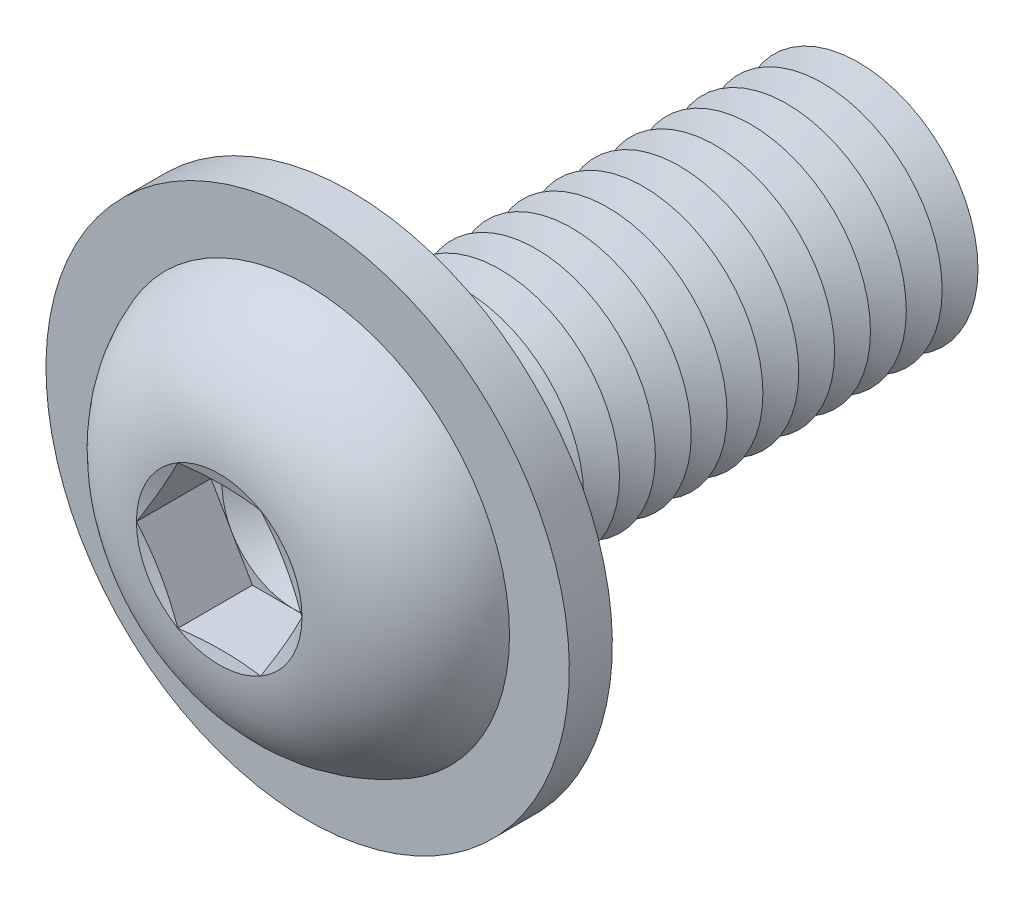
ISO-10303-21;
HEADER;
FILE_DESCRIPTION(('STEP AP214'),'2;1');
FILE_NAME('part.step','',(''),(''),'','','');
FILE_SCHEMA(('AUTOMOTIVE_DESIGN { 1 0 10303 214 1 1 1 1 }'));
ENDSEC;
DATA;
#1=APPLICATION_CONTEXT('core data for automotive mechanical design processes');
#2=APPLICATION_PROTOCOL_DEFINITION('international standard','automotive_design',2000,#1);
#3=PRODUCT_CONTEXT('',#1,'mechanical');
#4=PRODUCT('Part','Part','',(#3));
#5=PRODUCT_RELATED_PRODUCT_CATEGORY('part','',(#4));
#6=PRODUCT_DEFINITION_FORMATION('','',#4);
#7=PRODUCT_DEFINITION_CONTEXT('part definition',#1,'design');
#8=PRODUCT_DEFINITION('design','',#6,#7);
#9=PRODUCT_DEFINITION_SHAPE('','',#8);
#10=(LENGTH_UNIT() NAMED_UNIT(*) SI_UNIT(.MILLI.,.METRE.));
#11=(NAMED_UNIT(*) PLANE_ANGLE_UNIT() SI_UNIT($,.RADIAN.));
#12=(NAMED_UNIT(*) SI_UNIT($,.STERADIAN.) SOLID_ANGLE_UNIT());
#13=UNCERTAINTY_MEASURE_WITH_UNIT(LENGTH_MEASURE(1.E-05),#10,'distance_accuracy_value','');
#14=(GEOMETRIC_REPRESENTATION_CONTEXT(3) GLOBAL_UNCERTAINTY_ASSIGNED_CONTEXT((#13)) GLOBAL_UNIT_ASSIGNED_CONTEXT((#10,
#11,#12)) REPRESENTATION_CONTEXT('',''));
#15=CARTESIAN_POINT('',(0.,0.,0.));
#16=DIRECTION('',(0.,0.,1.));
#17=DIRECTION('',(1.,0.,0.));
#18=AXIS2_PLACEMENT_3D('',#15,#16,#17);
#19=CARTESIAN_POINT('',(0.,0.,-16.75));
#20=DIRECTION('',(0.,0.,1.));
#21=DIRECTION('',(1.,0.,0.));
#22=AXIS2_PLACEMENT_3D('',#19,#20,#21);
#23=CONICAL_SURFACE('',#22,5.00000000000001,1.0471975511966);
#24=CARTESIAN_POINT('',(0.,0.,-17.5));
#25=DIRECTION('',(0.,0.,1.));
#26=DIRECTION('',(1.,0.,0.));
#27=AXIS2_PLACEMENT_3D('',#24,#25,#26);
#28=CIRCLE('',#27,3.70096189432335);
#29=CARTESIAN_POINT('',(3.70096189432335,0.,-17.5));
#30=VERTEX_POINT('',#29);
#31=EDGE_CURVE('E406',#30,#30,#28,.T.);
#32=ORIENTED_EDGE('',*,*,#31,.T.);
#33=EDGE_LOOP('',(#32));
#34=FACE_BOUND('',#33,.T.);
#35=CARTESIAN_POINT('',(0.,0.,-16.75));
#36=DIRECTION('',(0.,0.,1.));
#37=DIRECTION('',(1.,0.,0.));
#38=AXIS2_PLACEMENT_3D('',#35,#36,#37);
#39=CIRCLE('',#38,5.00000000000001);
#40=CARTESIAN_POINT('',(5.00000000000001,0.,-16.75));
#41=VERTEX_POINT('',#40);
#42=EDGE_CURVE('E361',#41,#41,#39,.T.);
#43=ORIENTED_EDGE('',*,*,#42,.F.);
#44=EDGE_LOOP('',(#43));
#45=FACE_BOUND('',#44,.T.);
#46=ADVANCED_FACE('F39',(#34,#45),#23,.T.);
#47=CARTESIAN_POINT('',(0.,0.,-17.5));
#48=DIRECTION('',(0.,0.,-1.));
#49=DIRECTION('',(-1.,0.,0.));
#50=AXIS2_PLACEMENT_3D('',#47,#48,#49);
#51=CONICAL_SURFACE('',#50,3.70096189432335,1.0471975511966);
#52=CARTESIAN_POINT('',(0.,0.,-18.25));
#53=DIRECTION('',(0.,0.,1.));
#54=DIRECTION('',(1.,0.,0.));
#55=AXIS2_PLACEMENT_3D('',#52,#53,#54);
#56=CIRCLE('',#55,5.00000000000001);
#57=CARTESIAN_POINT('',(5.00000000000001,0.,-18.25));
#58=VERTEX_POINT('',#57);
#59=EDGE_CURVE('E408',#58,#58,#56,.T.);
#60=ORIENTED_EDGE('',*,*,#59,.T.);
#61=EDGE_LOOP('',(#60));
#62=FACE_BOUND('',#61,.T.);
#63=ORIENTED_EDGE('',*,*,#31,.F.);
#64=EDGE_LOOP('',(#63));
#65=FACE_BOUND('',#64,.T.);
#66=ADVANCED_FACE('F456',(#62,#65),#51,.T.);
#67=CARTESIAN_POINT('',(0.,5.00000000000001,-22.));
#68=DIRECTION('',(0.,0.,-1.));
#69=DIRECTION('',(-1.,0.,0.));
#70=AXIS2_PLACEMENT_3D('',#67,#68,#69);
#71=PLANE('',#70);
#72=CARTESIAN_POINT('',(0.,0.,-22.));
#73=DIRECTION('',(0.,0.,1.));
#74=DIRECTION('',(1.,0.,0.));
#75=AXIS2_PLACEMENT_3D('',#72,#73,#74);
#76=CIRCLE('',#75,3.70096189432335);
#77=CARTESIAN_POINT('',(3.70096189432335,0.,-22.));
#78=VERTEX_POINT('',#77);
#79=EDGE_CURVE('E307',#78,#78,#76,.T.);
#80=ORIENTED_EDGE('',*,*,#79,.F.);
#81=EDGE_LOOP('',(#80));
#82=FACE_BOUND('',#81,.T.);
#83=ADVANCED_FACE('F462',(#82),#71,.T.);
#84=CARTESIAN_POINT('',(0.,0.,-21.25));
#85=DIRECTION('',(0.,0.,1.));
#86=DIRECTION('',(1.,0.,0.));
#87=AXIS2_PLACEMENT_3D('',#84,#85,#86);
#88=CONICAL_SURFACE('',#87,5.00000000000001,1.0471975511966);
#89=ORIENTED_EDGE('',*,*,#79,.T.);
#90=EDGE_LOOP('',(#89));
#91=FACE_BOUND('',#90,.T.);
#92=CARTESIAN_POINT('',(0.,0.,-21.25));
#93=DIRECTION('',(0.,0.,1.));
#94=DIRECTION('',(1.,0.,0.));
#95=AXIS2_PLACEMENT_3D('',#92,#93,#94);
#96=CIRCLE('',#95,5.00000000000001);
#97=CARTESIAN_POINT('',(5.00000000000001,0.,-21.25));
#98=VERTEX_POINT('',#97);
#99=EDGE_CURVE('E494',#98,#98,#96,.T.);
#100=ORIENTED_EDGE('',*,*,#99,.F.);
#101=EDGE_LOOP('',(#100));
#102=FACE_BOUND('',#101,.T.);
#103=ADVANCED_FACE('F481',(#91,#102),#88,.T.);
#104=CARTESIAN_POINT('',(0.,0.,-20.5));
#105=DIRECTION('',(0.,0.,-1.));
#106=DIRECTION('',(-1.,0.,0.));
#107=AXIS2_PLACEMENT_3D('',#104,#105,#106);
#108=CONICAL_SURFACE('',#107,3.70096189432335,1.0471975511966);
#109=ORIENTED_EDGE('',*,*,#99,.T.);
#110=EDGE_LOOP('',(#109));
#111=FACE_BOUND('',#110,.T.);
#112=CARTESIAN_POINT('',(0.,0.,-20.5));
#113=DIRECTION('',(0.,0.,1.));
#114=DIRECTION('',(1.,0.,0.));
#115=AXIS2_PLACEMENT_3D('',#112,#113,#114);
#116=CIRCLE('',#115,3.70096189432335);
#117=CARTESIAN_POINT('',(3.70096189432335,0.,-20.5));
#118=VERTEX_POINT('',#117);
#119=EDGE_CURVE('E425',#118,#118,#116,.T.);
#120=ORIENTED_EDGE('',*,*,#119,.F.);
#121=EDGE_LOOP('',(#120));
#122=FACE_BOUND('',#121,.T.);
#123=ADVANCED_FACE('F478',(#111,#122),#108,.T.);
#124=CARTESIAN_POINT('',(0.,0.,-19.75));
#125=DIRECTION('',(0.,0.,1.));
#126=DIRECTION('',(1.,0.,0.));
#127=AXIS2_PLACEMENT_3D('',#124,#125,#126);
#128=CONICAL_SURFACE('',#127,5.00000000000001,1.0471975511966);
#129=ORIENTED_EDGE('',*,*,#119,.T.);
#130=EDGE_LOOP('',(#129));
#131=FACE_BOUND('',#130,.T.);
#132=CARTESIAN_POINT('',(0.,0.,-19.75));
#133=DIRECTION('',(0.,0.,1.));
#134=DIRECTION('',(1.,0.,0.));
#135=AXIS2_PLACEMENT_3D('',#132,#133,#134);
#136=CIRCLE('',#135,5.00000000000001);
#137=CARTESIAN_POINT('',(5.00000000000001,0.,-19.75));
#138=VERTEX_POINT('',#137);
#139=EDGE_CURVE('E423',#138,#138,#136,.T.);
#140=ORIENTED_EDGE('',*,*,#139,.F.);
#141=EDGE_LOOP('',(#140));
#142=FACE_BOUND('',#141,.T.);
#143=ADVANCED_FACE('F472',(#131,#142),#128,.T.);
#144=CARTESIAN_POINT('',(0.,0.,-19.));
#145=DIRECTION('',(0.,0.,-1.));
#146=DIRECTION('',(-1.,0.,0.));
#147=AXIS2_PLACEMENT_3D('',#144,#145,#146);
#148=CONICAL_SURFACE('',#147,3.70096189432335,1.0471975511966);
#149=ORIENTED_EDGE('',*,*,#139,.T.);
#150=EDGE_LOOP('',(#149));
#151=FACE_BOUND('',#150,.T.);
#152=CARTESIAN_POINT('',(0.,0.,-19.));
#153=DIRECTION('',(0.,0.,1.));
#154=DIRECTION('',(1.,0.,0.));
#155=AXIS2_PLACEMENT_3D('',#152,#153,#154);
#156=CIRCLE('',#155,3.70096189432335);
#157=CARTESIAN_POINT('',(3.70096189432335,0.,-19.));
#158=VERTEX_POINT('',#157);
#159=EDGE_CURVE('E426',#158,#158,#156,.T.);
#160=ORIENTED_EDGE('',*,*,#159,.F.);
#161=EDGE_LOOP('',(#160));
#162=FACE_BOUND('',#161,.T.);
#163=ADVANCED_FACE('F468',(#151,#162),#148,.T.);
#164=CARTESIAN_POINT('',(0.,0.,-18.25));
#165=DIRECTION('',(0.,0.,1.));
#166=DIRECTION('',(1.,0.,0.));
#167=AXIS2_PLACEMENT_3D('',#164,#165,#166);
#168=CONICAL_SURFACE('',#167,5.00000000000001,1.0471975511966);
#169=ORIENTED_EDGE('',*,*,#159,.T.);
#170=EDGE_LOOP('',(#169));
#171=FACE_BOUND('',#170,.T.);
#172=ORIENTED_EDGE('',*,*,#59,.F.);
#173=EDGE_LOOP('',(#172));
#174=FACE_BOUND('',#173,.T.);
#175=ADVANCED_FACE('F471',(#171,#174),#168,.T.);
#176=CARTESIAN_POINT('',(0.,0.,-15.25));
#177=DIRECTION('',(0.,0.,1.));
#178=DIRECTION('',(1.,0.,0.));
#179=AXIS2_PLACEMENT_3D('',#176,#177,#178);
#180=CONICAL_SURFACE('',#179,5.00000000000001,1.0471975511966);
#181=CARTESIAN_POINT('',(0.,0.,-16.));
#182=DIRECTION('',(0.,0.,1.));
#183=DIRECTION('',(1.,0.,0.));
#184=AXIS2_PLACEMENT_3D('',#181,#182,#183);
#185=CIRCLE('',#184,3.70096189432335);
#186=CARTESIAN_POINT('',(3.70096189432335,0.,-16.));
#187=VERTEX_POINT('',#186);
#188=EDGE_CURVE('E359',#187,#187,#185,.T.);
#189=ORIENTED_EDGE('',*,*,#188,.T.);
#190=EDGE_LOOP('',(#189));
#191=FACE_BOUND('',#190,.T.);
#192=CARTESIAN_POINT('',(0.,0.,-15.25));
#193=DIRECTION('',(0.,0.,1.));
#194=DIRECTION('',(1.,0.,0.));
#195=AXIS2_PLACEMENT_3D('',#192,#193,#194);
#196=CIRCLE('',#195,5.00000000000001);
#197=CARTESIAN_POINT('',(5.00000000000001,0.,-15.25));
#198=VERTEX_POINT('',#197);
#199=EDGE_CURVE('E356',#198,#198,#196,.T.);
#200=ORIENTED_EDGE('',*,*,#199,.F.);
#201=EDGE_LOOP('',(#200));
#202=FACE_BOUND('',#201,.T.);
#203=ADVANCED_FACE('F476',(#191,#202),#180,.T.);
#204=CARTESIAN_POINT('',(0.,0.,-16.));
#205=DIRECTION('',(0.,0.,-1.));
#206=DIRECTION('',(-1.,0.,0.));
#207=AXIS2_PLACEMENT_3D('',#204,#205,#206);
#208=CONICAL_SURFACE('',#207,3.70096189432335,1.0471975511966);
#209=ORIENTED_EDGE('',*,*,#42,.T.);
#210=EDGE_LOOP('',(#209));
#211=FACE_BOUND('',#210,.T.);
#212=ORIENTED_EDGE('',*,*,#188,.F.);
#213=EDGE_LOOP('',(#212));
#214=FACE_BOUND('',#213,.T.);
#215=ADVANCED_FACE('F595',(#211,#214),#208,.T.);
#216=CARTESIAN_POINT('',(0.,0.,-13.75));
#217=DIRECTION('',(0.,0.,1.));
#218=DIRECTION('',(1.,0.,0.));
#219=AXIS2_PLACEMENT_3D('',#216,#217,#218);
#220=CONICAL_SURFACE('',#219,5.00000000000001,1.0471975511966);
#221=CARTESIAN_POINT('',(0.,0.,-14.5));
#222=DIRECTION('',(0.,0.,1.));
#223=DIRECTION('',(1.,0.,0.));
#224=AXIS2_PLACEMENT_3D('',#221,#222,#223);
#225=CIRCLE('',#224,3.70096189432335);
#226=CARTESIAN_POINT('',(3.70096189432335,0.,-14.5));
#227=VERTEX_POINT('',#226);
#228=EDGE_CURVE('E353',#227,#227,#225,.T.);
#229=ORIENTED_EDGE('',*,*,#228,.T.);
#230=EDGE_LOOP('',(#229));
#231=FACE_BOUND('',#230,.T.);
#232=CARTESIAN_POINT('',(0.,0.,-13.75));
#233=DIRECTION('',(0.,0.,1.));
#234=DIRECTION('',(1.,0.,0.));
#235=AXIS2_PLACEMENT_3D('',#232,#233,#234);
#236=CIRCLE('',#235,5.00000000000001);
#237=CARTESIAN_POINT('',(5.00000000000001,0.,-13.75));
#238=VERTEX_POINT('',#237);
#239=EDGE_CURVE('E357',#238,#238,#236,.T.);
#240=ORIENTED_EDGE('',*,*,#239,.F.);
#241=EDGE_LOOP('',(#240));
#242=FACE_BOUND('',#241,.T.);
#243=ADVANCED_FACE('F591',(#231,#242),#220,.T.);
#244=CARTESIAN_POINT('',(0.,0.,-14.5));
#245=DIRECTION('',(0.,0.,-1.));
#246=DIRECTION('',(-1.,0.,0.));
#247=AXIS2_PLACEMENT_3D('',#244,#245,#246);
#248=CONICAL_SURFACE('',#247,3.70096189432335,1.0471975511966);
#249=ORIENTED_EDGE('',*,*,#199,.T.);
#250=EDGE_LOOP('',(#249));
#251=FACE_BOUND('',#250,.T.);
#252=ORIENTED_EDGE('',*,*,#228,.F.);
#253=EDGE_LOOP('',(#252));
#254=FACE_BOUND('',#253,.T.);
#255=ADVANCED_FACE('F587',(#251,#254),#248,.T.);
#256=CARTESIAN_POINT('',(0.,0.,-12.25));
#257=DIRECTION('',(0.,0.,1.));
#258=DIRECTION('',(1.,0.,0.));
#259=AXIS2_PLACEMENT_3D('',#256,#257,#258);
#260=CONICAL_SURFACE('',#259,5.00000000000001,1.0471975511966);
#261=CARTESIAN_POINT('',(0.,0.,-13.));
#262=DIRECTION('',(0.,0.,1.));
#263=DIRECTION('',(1.,0.,0.));
#264=AXIS2_PLACEMENT_3D('',#261,#262,#263);
#265=CIRCLE('',#264,3.70096189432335);
#266=CARTESIAN_POINT('',(3.70096189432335,0.,-13.));
#267=VERTEX_POINT('',#266);
#268=EDGE_CURVE('E403',#267,#267,#265,.T.);
#269=ORIENTED_EDGE('',*,*,#268,.T.);
#270=EDGE_LOOP('',(#269));
#271=FACE_BOUND('',#270,.T.);
#272=CARTESIAN_POINT('',(0.,0.,-12.25));
#273=DIRECTION('',(0.,0.,1.));
#274=DIRECTION('',(1.,0.,0.));
#275=AXIS2_PLACEMENT_3D('',#272,#273,#274);
#276=CIRCLE('',#275,5.00000000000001);
#277=CARTESIAN_POINT('',(5.00000000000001,0.,-12.25));
#278=VERTEX_POINT('',#277);
#279=EDGE_CURVE('E417',#278,#278,#276,.T.);
#280=ORIENTED_EDGE('',*,*,#279,.F.);
#281=EDGE_LOOP('',(#280));
#282=FACE_BOUND('',#281,.T.);
#283=ADVANCED_FACE('F583',(#271,#282),#260,.T.);
#284=CARTESIAN_POINT('',(0.,0.,-13.));
#285=DIRECTION('',(0.,0.,-1.));
#286=DIRECTION('',(-1.,0.,0.));
#287=AXIS2_PLACEMENT_3D('',#284,#285,#286);
#288=CONICAL_SURFACE('',#287,3.70096189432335,1.0471975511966);
#289=ORIENTED_EDGE('',*,*,#239,.T.);
#290=EDGE_LOOP('',(#289));
#291=FACE_BOUND('',#290,.T.);
#292=ORIENTED_EDGE('',*,*,#268,.F.);
#293=EDGE_LOOP('',(#292));
#294=FACE_BOUND('',#293,.T.);
#295=ADVANCED_FACE('F579',(#291,#294),#288,.T.);
#296=CARTESIAN_POINT('',(0.,0.,-10.75));
#297=DIRECTION('',(0.,0.,1.));
#298=DIRECTION('',(1.,0.,0.));
#299=AXIS2_PLACEMENT_3D('',#296,#297,#298);
#300=CONICAL_SURFACE('',#299,5.00000000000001,1.0471975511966);
#301=CARTESIAN_POINT('',(0.,0.,-11.5));
#302=DIRECTION('',(0.,0.,1.));
#303=DIRECTION('',(1.,0.,0.));
#304=AXIS2_PLACEMENT_3D('',#301,#302,#303);
#305=CIRCLE('',#304,3.70096189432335);
#306=CARTESIAN_POINT('',(3.70096189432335,0.,-11.5));
#307=VERTEX_POINT('',#306);
#308=EDGE_CURVE('E414',#307,#307,#305,.T.);
#309=ORIENTED_EDGE('',*,*,#308,.T.);
#310=EDGE_LOOP('',(#309));
#311=FACE_BOUND('',#310,.T.);
#312=CARTESIAN_POINT('',(0.,0.,-10.75));
#313=DIRECTION('',(0.,0.,1.));
#314=DIRECTION('',(1.,0.,0.));
#315=AXIS2_PLACEMENT_3D('',#312,#313,#314);
#316=CIRCLE('',#315,5.00000000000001);
#317=CARTESIAN_POINT('',(5.00000000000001,0.,-10.75));
#318=VERTEX_POINT('',#317);
#319=EDGE_CURVE('E418',#318,#318,#316,.T.);
#320=ORIENTED_EDGE('',*,*,#319,.F.);
#321=EDGE_LOOP('',(#320));
#322=FACE_BOUND('',#321,.T.);
#323=ADVANCED_FACE('F575',(#311,#322),#300,.T.);
#324=CARTESIAN_POINT('',(0.,0.,-11.5));
#325=DIRECTION('',(0.,0.,-1.));
#326=DIRECTION('',(-1.,0.,0.));
#327=AXIS2_PLACEMENT_3D('',#324,#325,#326);
#328=CONICAL_SURFACE('',#327,3.70096189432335,1.0471975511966);
#329=ORIENTED_EDGE('',*,*,#279,.T.);
#330=EDGE_LOOP('',(#329));
#331=FACE_BOUND('',#330,.T.);
#332=ORIENTED_EDGE('',*,*,#308,.F.);
#333=EDGE_LOOP('',(#332));
#334=FACE_BOUND('',#333,.T.);
#335=ADVANCED_FACE('F571',(#331,#334),#328,.T.);
#336=CARTESIAN_POINT('',(0.,0.,-9.25));
#337=DIRECTION('',(0.,0.,1.));
#338=DIRECTION('',(1.,0.,0.));
#339=AXIS2_PLACEMENT_3D('',#336,#337,#338);
#340=CONICAL_SURFACE('',#339,5.00000000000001,1.0471975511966);
#341=CARTESIAN_POINT('',(0.,0.,-10.));
#342=DIRECTION('',(0.,0.,1.));
#343=DIRECTION('',(1.,0.,0.));
#344=AXIS2_PLACEMENT_3D('',#341,#342,#343);
#345=CIRCLE('',#344,3.70096189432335);
#346=CARTESIAN_POINT('',(3.70096189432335,0.,-10.));
#347=VERTEX_POINT('',#346);
#348=EDGE_CURVE('E519',#347,#347,#345,.T.);
#349=ORIENTED_EDGE('',*,*,#348,.T.);
#350=EDGE_LOOP('',(#349));
#351=FACE_BOUND('',#350,.T.);
#352=CARTESIAN_POINT('',(0.,0.,-9.25));
#353=DIRECTION('',(0.,0.,1.));
#354=DIRECTION('',(1.,0.,0.));
#355=AXIS2_PLACEMENT_3D('',#352,#353,#354);
#356=CIRCLE('',#355,5.00000000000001);
#357=CARTESIAN_POINT('',(5.00000000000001,0.,-9.25));
#358=VERTEX_POINT('',#357);
#359=EDGE_CURVE('E439',#358,#358,#356,.T.);
#360=ORIENTED_EDGE('',*,*,#359,.F.);
#361=EDGE_LOOP('',(#360));
#362=FACE_BOUND('',#361,.T.);
#363=ADVANCED_FACE('F567',(#351,#362),#340,.T.);
#364=CARTESIAN_POINT('',(0.,0.,-10.));
#365=DIRECTION('',(0.,0.,-1.));
#366=DIRECTION('',(-1.,0.,0.));
#367=AXIS2_PLACEMENT_3D('',#364,#365,#366);
#368=CONICAL_SURFACE('',#367,3.70096189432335,1.0471975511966);
#369=ORIENTED_EDGE('',*,*,#319,.T.);
#370=EDGE_LOOP('',(#369));
#371=FACE_BOUND('',#370,.T.);
#372=ORIENTED_EDGE('',*,*,#348,.F.);
#373=EDGE_LOOP('',(#372));
#374=FACE_BOUND('',#373,.T.);
#375=ADVANCED_FACE('F563',(#371,#374),#368,.T.);
#376=CARTESIAN_POINT('',(0.,0.,-7.75));
#377=DIRECTION('',(0.,0.,1.));
#378=DIRECTION('',(1.,0.,0.));
#379=AXIS2_PLACEMENT_3D('',#376,#377,#378);
#380=CONICAL_SURFACE('',#379,5.00000000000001,1.0471975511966);
#381=CARTESIAN_POINT('',(0.,0.,-8.5));
#382=DIRECTION('',(0.,0.,1.));
#383=DIRECTION('',(1.,0.,0.));
#384=AXIS2_PLACEMENT_3D('',#381,#382,#383);
#385=CIRCLE('',#384,3.70096189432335);
#386=CARTESIAN_POINT('',(3.70096189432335,0.,-8.5));
#387=VERTEX_POINT('',#386);
#388=EDGE_CURVE('E436',#387,#387,#385,.T.);
#389=ORIENTED_EDGE('',*,*,#388,.T.);
#390=EDGE_LOOP('',(#389));
#391=FACE_BOUND('',#390,.T.);
#392=CARTESIAN_POINT('',(0.,0.,-7.75));
#393=DIRECTION('',(0.,0.,1.));
#394=DIRECTION('',(1.,0.,0.));
#395=AXIS2_PLACEMENT_3D('',#392,#393,#394);
#396=CIRCLE('',#395,5.00000000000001);
#397=CARTESIAN_POINT('',(5.00000000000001,0.,-7.75));
#398=VERTEX_POINT('',#397);
#399=EDGE_CURVE('E346',#398,#398,#396,.T.);
#400=ORIENTED_EDGE('',*,*,#399,.F.);
#401=EDGE_LOOP('',(#400));
#402=FACE_BOUND('',#401,.T.);
#403=ADVANCED_FACE('F559',(#391,#402),#380,.T.);
#404=CARTESIAN_POINT('',(0.,0.,-8.5));
#405=DIRECTION('',(0.,0.,-1.));
#406=DIRECTION('',(-1.,0.,0.));
#407=AXIS2_PLACEMENT_3D('',#404,#405,#406);
#408=CONICAL_SURFACE('',#407,3.70096189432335,1.0471975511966);
#409=ORIENTED_EDGE('',*,*,#359,.T.);
#410=EDGE_LOOP('',(#409));
#411=FACE_BOUND('',#410,.T.);
#412=ORIENTED_EDGE('',*,*,#388,.F.);
#413=EDGE_LOOP('',(#412));
#414=FACE_BOUND('',#413,.T.);
#415=ADVANCED_FACE('F555',(#411,#414),#408,.T.);
#416=CARTESIAN_POINT('',(0.,0.,-6.25));
#417=DIRECTION('',(0.,0.,1.));
#418=DIRECTION('',(1.,0.,0.));
#419=AXIS2_PLACEMENT_3D('',#416,#417,#418);
#420=CONICAL_SURFACE('',#419,5.00000000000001,1.0471975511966);
#421=CARTESIAN_POINT('',(0.,0.,-7.));
#422=DIRECTION('',(0.,0.,1.));
#423=DIRECTION('',(1.,0.,0.));
#424=AXIS2_PLACEMENT_3D('',#421,#422,#423);
#425=CIRCLE('',#424,3.70096189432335);
#426=CARTESIAN_POINT('',(3.70096189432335,0.,-7.));
#427=VERTEX_POINT('',#426);
#428=EDGE_CURVE('E336',#427,#427,#425,.T.);
#429=ORIENTED_EDGE('',*,*,#428,.T.);
#430=EDGE_LOOP('',(#429));
#431=FACE_BOUND('',#430,.T.);
#432=CARTESIAN_POINT('',(0.,0.,-6.25));
#433=DIRECTION('',(0.,0.,1.));
#434=DIRECTION('',(1.,0.,0.));
#435=AXIS2_PLACEMENT_3D('',#432,#433,#434);
#436=CIRCLE('',#435,5.00000000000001);
#437=CARTESIAN_POINT('',(5.00000000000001,0.,-6.25));
#438=VERTEX_POINT('',#437);
#439=EDGE_CURVE('E334',#438,#438,#436,.T.);
#440=ORIENTED_EDGE('',*,*,#439,.F.);
#441=EDGE_LOOP('',(#440));
#442=FACE_BOUND('',#441,.T.);
#443=ADVANCED_FACE('F548',(#431,#442),#420,.T.);
#444=CARTESIAN_POINT('',(0.,0.,-7.));
#445=DIRECTION('',(0.,0.,-1.));
#446=DIRECTION('',(-1.,0.,0.));
#447=AXIS2_PLACEMENT_3D('',#444,#445,#446);
#448=CONICAL_SURFACE('',#447,3.70096189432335,1.0471975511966);
#449=ORIENTED_EDGE('',*,*,#399,.T.);
#450=EDGE_LOOP('',(#449));
#451=FACE_BOUND('',#450,.T.);
#452=ORIENTED_EDGE('',*,*,#428,.F.);
#453=EDGE_LOOP('',(#452));
#454=FACE_BOUND('',#453,.T.);
#455=ADVANCED_FACE('F538',(#451,#454),#448,.T.);
#456=CARTESIAN_POINT('',(0.,0.,-4.75));
#457=DIRECTION('',(0.,0.,1.));
#458=DIRECTION('',(1.,0.,0.));
#459=AXIS2_PLACEMENT_3D('',#456,#457,#458);
#460=CONICAL_SURFACE('',#459,5.00000000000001,1.0471975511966);
#461=CARTESIAN_POINT('',(0.,0.,-5.5));
#462=DIRECTION('',(0.,0.,1.));
#463=DIRECTION('',(1.,0.,0.));
#464=AXIS2_PLACEMENT_3D('',#461,#462,#463);
#465=CIRCLE('',#464,3.70096189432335);
#466=CARTESIAN_POINT('',(3.70096189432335,0.,-5.5));
#467=VERTEX_POINT('',#466);
#468=EDGE_CURVE('E337',#467,#467,#465,.T.);
#469=ORIENTED_EDGE('',*,*,#468,.T.);
#470=EDGE_LOOP('',(#469));
#471=FACE_BOUND('',#470,.T.);
#472=CARTESIAN_POINT('',(0.,0.,-4.75));
#473=DIRECTION('',(0.,0.,1.));
#474=DIRECTION('',(1.,0.,0.));
#475=AXIS2_PLACEMENT_3D('',#472,#473,#474);
#476=CIRCLE('',#475,5.00000000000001);
#477=CARTESIAN_POINT('',(5.00000000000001,0.,-4.75));
#478=VERTEX_POINT('',#477);
#479=EDGE_CURVE('E331',#478,#478,#476,.T.);
#480=ORIENTED_EDGE('',*,*,#479,.F.);
#481=EDGE_LOOP('',(#480));
#482=FACE_BOUND('',#481,.T.);
#483=ADVANCED_FACE('F535',(#471,#482),#460,.T.);
#484=CARTESIAN_POINT('',(0.,0.,-5.5));
#485=DIRECTION('',(0.,0.,-1.));
#486=DIRECTION('',(-1.,0.,0.));
#487=AXIS2_PLACEMENT_3D('',#484,#485,#486);
#488=CONICAL_SURFACE('',#487,3.70096189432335,1.0471975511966);
#489=ORIENTED_EDGE('',*,*,#439,.T.);
#490=EDGE_LOOP('',(#489));
#491=FACE_BOUND('',#490,.T.);
#492=ORIENTED_EDGE('',*,*,#468,.F.);
#493=EDGE_LOOP('',(#492));
#494=FACE_BOUND('',#493,.T.);
#495=ADVANCED_FACE('F537',(#491,#494),#488,.T.);
#496=CARTESIAN_POINT('',(0.,0.,-3.25));
#497=DIRECTION('',(0.,0.,1.));
#498=DIRECTION('',(1.,0.,0.));
#499=AXIS2_PLACEMENT_3D('',#496,#497,#498);
#500=CONICAL_SURFACE('',#499,5.00000000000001,1.0471975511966);
#501=CARTESIAN_POINT('',(0.,0.,-4.));
#502=DIRECTION('',(0.,0.,1.));
#503=DIRECTION('',(1.,0.,0.));
#504=AXIS2_PLACEMENT_3D('',#501,#502,#503);
#505=CIRCLE('',#504,3.70096189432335);
#506=CARTESIAN_POINT('',(3.70096189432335,0.,-4.));
#507=VERTEX_POINT('',#506);
#508=EDGE_CURVE('E328',#507,#507,#505,.T.);
#509=ORIENTED_EDGE('',*,*,#508,.T.);
#510=EDGE_LOOP('',(#509));
#511=FACE_BOUND('',#510,.T.);
#512=CARTESIAN_POINT('',(0.,0.,-3.25));
#513=DIRECTION('',(0.,0.,1.));
#514=DIRECTION('',(1.,0.,0.));
#515=AXIS2_PLACEMENT_3D('',#512,#513,#514);
#516=CIRCLE('',#515,5.00000000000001);
#517=CARTESIAN_POINT('',(5.00000000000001,0.,-3.25));
#518=VERTEX_POINT('',#517);
#519=EDGE_CURVE('E342',#518,#518,#516,.T.);
#520=ORIENTED_EDGE('',*,*,#519,.F.);
#521=EDGE_LOOP('',(#520));
#522=FACE_BOUND('',#521,.T.);
#523=ADVANCED_FACE('F545',(#511,#522),#500,.T.);
#524=CARTESIAN_POINT('',(0.,0.,-4.));
#525=DIRECTION('',(0.,0.,-1.));
#526=DIRECTION('',(-1.,0.,0.));
#527=AXIS2_PLACEMENT_3D('',#524,#525,#526);
#528=CONICAL_SURFACE('',#527,3.70096189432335,1.0471975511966);
#529=ORIENTED_EDGE('',*,*,#479,.T.);
#530=EDGE_LOOP('',(#529));
#531=FACE_BOUND('',#530,.T.);
#532=ORIENTED_EDGE('',*,*,#508,.F.);
#533=EDGE_LOOP('',(#532));
#534=FACE_BOUND('',#533,.T.);
#535=ADVANCED_FACE('F532',(#531,#534),#528,.T.);
#536=CARTESIAN_POINT('',(0.,0.,-1.75));
#537=DIRECTION('',(0.,0.,1.));
#538=DIRECTION('',(1.,0.,0.));
#539=AXIS2_PLACEMENT_3D('',#536,#537,#538);
#540=CONICAL_SURFACE('',#539,5.00000000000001,1.0471975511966);
#541=CARTESIAN_POINT('',(0.,0.,-2.5));
#542=DIRECTION('',(0.,0.,1.));
#543=DIRECTION('',(1.,0.,0.));
#544=AXIS2_PLACEMENT_3D('',#541,#542,#543);
#545=CIRCLE('',#544,3.70096189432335);
#546=CARTESIAN_POINT('',(3.70096189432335,0.,-2.5));
#547=VERTEX_POINT('',#546);
#548=EDGE_CURVE('E227',#547,#547,#545,.T.);
#549=ORIENTED_EDGE('',*,*,#548,.T.);
#550=EDGE_LOOP('',(#549));
#551=FACE_BOUND('',#550,.T.);
#552=CARTESIAN_POINT('',(0.,0.,-1.75));
#553=DIRECTION('',(0.,0.,1.));
#554=DIRECTION('',(1.,0.,0.));
#555=AXIS2_PLACEMENT_3D('',#552,#553,#554);
#556=CIRCLE('',#555,5.00000000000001);
#557=CARTESIAN_POINT('',(5.00000000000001,0.,-1.75));
#558=VERTEX_POINT('',#557);
#559=EDGE_CURVE('E332',#558,#558,#556,.T.);
#560=ORIENTED_EDGE('',*,*,#559,.F.);
#561=EDGE_LOOP('',(#560));
#562=FACE_BOUND('',#561,.T.);
#563=ADVANCED_FACE('F696',(#551,#562),#540,.T.);
#564=CARTESIAN_POINT('',(0.,0.,-2.5));
#565=DIRECTION('',(0.,0.,-1.));
#566=DIRECTION('',(-1.,0.,0.));
#567=AXIS2_PLACEMENT_3D('',#564,#565,#566);
#568=CONICAL_SURFACE('',#567,3.70096189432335,1.0471975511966);
#569=ORIENTED_EDGE('',*,*,#519,.T.);
#570=EDGE_LOOP('',(#569));
#571=FACE_BOUND('',#570,.T.);
#572=ORIENTED_EDGE('',*,*,#548,.F.);
#573=EDGE_LOOP('',(#572));
#574=FACE_BOUND('',#573,.T.);
#575=ADVANCED_FACE('F211',(#571,#574),#568,.T.);
#576=CARTESIAN_POINT('',(0.,5.,0.));
#577=DIRECTION('',(0.,0.,-1.));
#578=DIRECTION('',(-1.,0.,0.));
#579=AXIS2_PLACEMENT_3D('',#576,#577,#578);
#580=PLANE('',#579);
#581=CARTESIAN_POINT('',(0.,0.,0.));
#582=DIRECTION('',(0.,0.,-1.));
#583=DIRECTION('',(-1.,0.,0.));
#584=AXIS2_PLACEMENT_3D('',#581,#582,#583);
#585=CIRCLE('',#584,5.75000000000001);
#586=CARTESIAN_POINT('',(-5.75000000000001,0.,0.));
#587=VERTEX_POINT('',#586);
#588=EDGE_CURVE('E282',#587,#587,#585,.F.);
#589=ORIENTED_EDGE('',*,*,#588,.T.);
#590=EDGE_LOOP('',(#589));
#591=FACE_BOUND('',#590,.T.);
#592=CARTESIAN_POINT('',(0.,0.,0.));
#593=DIRECTION('',(0.,0.,-1.));
#594=DIRECTION('',(0.,1.,0.));
#595=AXIS2_PLACEMENT_3D('',#592,#593,#594);
#596=CIRCLE('',#595,10.95);
#597=CARTESIAN_POINT('',(0.,10.95,0.));
#598=VERTEX_POINT('',#597);
#599=EDGE_CURVE('E430',#598,#598,#596,.T.);
#600=ORIENTED_EDGE('',*,*,#599,.T.);
#601=EDGE_LOOP('',(#600));
#602=FACE_BOUND('',#601,.T.);
#603=ADVANCED_FACE('F711',(#591,#602),#580,.T.);
#604=CARTESIAN_POINT('',(0.,0.,-0.750000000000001));
#605=DIRECTION('',(0.,0.,-1.));
#606=DIRECTION('',(-1.,0.,0.));
#607=AXIS2_PLACEMENT_3D('',#604,#605,#606);
#608=TOROIDAL_SURFACE('',#607,5.75000000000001,0.75);
#609=ORIENTED_EDGE('',*,*,#588,.F.);
#610=EDGE_LOOP('',(#609));
#611=FACE_BOUND('',#610,.T.);
#612=CARTESIAN_POINT('',(0.,0.,-0.750000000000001));
#613=DIRECTION('',(0.,0.,-1.));
#614=DIRECTION('',(-1.,0.,0.));
#615=AXIS2_PLACEMENT_3D('',#612,#613,#614);
#616=CIRCLE('',#615,5.00000000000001);
#617=CARTESIAN_POINT('',(-5.00000000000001,0.,-0.750000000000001));
#618=VERTEX_POINT('',#617);
#619=EDGE_CURVE('E289',#618,#618,#616,.T.);
#620=ORIENTED_EDGE('',*,*,#619,.F.);
#621=EDGE_LOOP('',(#620));
#622=FACE_BOUND('',#621,.T.);
#623=ADVANCED_FACE('F41',(#611,#622),#608,.F.);
#624=CARTESIAN_POINT('',(0.,0.,-22.));
#625=DIRECTION('',(0.,0.,-1.));
#626=DIRECTION('',(-1.,0.,0.));
#627=AXIS2_PLACEMENT_3D('',#624,#625,#626);
#628=CYLINDRICAL_SURFACE('',#627,5.00000000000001);
#629=ORIENTED_EDGE('',*,*,#619,.T.);
#630=EDGE_LOOP('',(#629));
#631=FACE_BOUND('',#630,.T.);
#632=ORIENTED_EDGE('',*,*,#559,.T.);
#633=EDGE_LOOP('',(#632));
#634=FACE_BOUND('',#633,.T.);
#635=ADVANCED_FACE('F729',(#631,#634),#628,.T.);
#636=CARTESIAN_POINT('',(0.,0.,1.8));
#637=DIRECTION('',(0.,0.,-1.));
#638=DIRECTION('',(0.,1.,0.));
#639=AXIS2_PLACEMENT_3D('',#636,#637,#638);
#640=CYLINDRICAL_SURFACE('',#639,10.95);
#641=CARTESIAN_POINT('',(0.,0.,1.8));
#642=DIRECTION('',(0.,0.,-1.));
#643=DIRECTION('',(0.,1.,0.));
#644=AXIS2_PLACEMENT_3D('',#641,#642,#643);
#645=CIRCLE('',#644,10.95);
#646=CARTESIAN_POINT('',(0.,10.95,1.8));
#647=VERTEX_POINT('',#646);
#648=EDGE_CURVE('E433',#647,#647,#645,.T.);
#649=ORIENTED_EDGE('',*,*,#648,.T.);
#650=EDGE_LOOP('',(#649));
#651=FACE_BOUND('',#650,.T.);
#652=ORIENTED_EDGE('',*,*,#599,.F.);
#653=EDGE_LOOP('',(#652));
#654=FACE_BOUND('',#653,.T.);
#655=ADVANCED_FACE('F737',(#651,#654),#640,.T.);
#656=CARTESIAN_POINT('',(0.,0.,1.8));
#657=DIRECTION('',(0.,0.,-1.));
#658=DIRECTION('',(0.,1.,0.));
#659=AXIS2_PLACEMENT_3D('',#656,#657,#658);
#660=PLANE('',#659);
#661=CARTESIAN_POINT('',(0.,0.,1.8));
#662=DIRECTION('',(0.,0.,-1.));
#663=DIRECTION('',(0.,1.,0.));
#664=AXIS2_PLACEMENT_3D('',#661,#662,#663);
#665=CIRCLE('',#664,8.44736706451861);
#666=CARTESIAN_POINT('',(0.,8.44736706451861,1.8));
#667=VERTEX_POINT('',#666);
#668=EDGE_CURVE('E43',#667,#667,#665,.F.);
#669=ORIENTED_EDGE('',*,*,#668,.F.);
#670=EDGE_LOOP('',(#669));
#671=FACE_BOUND('',#670,.T.);
#672=ORIENTED_EDGE('',*,*,#648,.F.);
#673=EDGE_LOOP('',(#672));
#674=FACE_BOUND('',#673,.T.);
#675=ADVANCED_FACE('F117',(#671,#674),#660,.F.);
#676=CARTESIAN_POINT('',(0.,0.,2.38));
#677=DIRECTION('',(0.,0.,1.));
#678=DIRECTION('',(1.,0.,0.));
#679=AXIS2_PLACEMENT_3D('',#676,#677,#678);
#680=CONICAL_SURFACE('',#679,2.99999860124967,1.0471975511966);
#681=CARTESIAN_POINT('',(0.,0.,0.64795000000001));
#682=VERTEX_POINT('',#681);
#683=VERTEX_LOOP('',#682);
#684=FACE_BOUND('',#683,.T.);
#685=CARTESIAN_POINT('',(0.,0.,2.38));
#686=DIRECTION('',(0.,0.,1.));
#687=DIRECTION('',(1.,0.,0.));
#688=AXIS2_PLACEMENT_3D('',#685,#686,#687);
#689=CIRCLE('',#688,2.99999860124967);
#690=CARTESIAN_POINT('',(2.598075,1.49999930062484,2.38));
#691=VERTEX_POINT('',#690);
#692=CARTESIAN_POINT('',(0.,2.99999860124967,2.38));
#693=VERTEX_POINT('',#692);
#694=EDGE_CURVE('E120',#691,#693,#689,.T.);
#695=ORIENTED_EDGE('',*,*,#694,.T.);
#696=CARTESIAN_POINT('',(0.,0.,2.38));
#697=DIRECTION('',(0.,0.,1.));
#698=DIRECTION('',(1.,0.,0.));
#699=AXIS2_PLACEMENT_3D('',#696,#697,#698);
#700=CIRCLE('',#699,2.99999860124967);
#701=CARTESIAN_POINT('',(-2.598075,1.49999930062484,2.38));
#702=VERTEX_POINT('',#701);
#703=EDGE_CURVE('E11',#693,#702,#700,.T.);
#704=ORIENTED_EDGE('',*,*,#703,.T.);
#705=CARTESIAN_POINT('',(-2.598075,-1.49999930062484,2.38));
#706=VERTEX_POINT('',#705);
#707=EDGE_CURVE('E49',#702,#706,#700,.T.);
#708=ORIENTED_EDGE('',*,*,#707,.T.);
#709=CARTESIAN_POINT('',(0.,-2.99999860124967,2.38));
#710=VERTEX_POINT('',#709);
#711=EDGE_CURVE('E286',#706,#710,#700,.T.);
#712=ORIENTED_EDGE('',*,*,#711,.T.);
#713=CARTESIAN_POINT('',(2.598075,-1.49999930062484,2.38));
#714=VERTEX_POINT('',#713);
#715=EDGE_CURVE('E57',#710,#714,#700,.T.);
#716=ORIENTED_EDGE('',*,*,#715,.T.);
#717=EDGE_CURVE('E50',#714,#691,#700,.T.);
#718=ORIENTED_EDGE('',*,*,#717,.T.);
#719=EDGE_LOOP('',(#695,#704,#708,#712,#716,#718));
#720=FACE_BOUND('',#719,.T.);
#721=ADVANCED_FACE('F114',(#684,#720),#680,.F.);
#722=CARTESIAN_POINT('',(0.,0.,2.38));
#723=DIRECTION('',(0.,0.,1.));
#724=DIRECTION('',(1.,0.,0.));
#725=AXIS2_PLACEMENT_3D('',#722,#723,#724);
#726=PLANE('',#725);
#727=ORIENTED_EDGE('',*,*,#711,.F.);
#728=DIRECTION('',(0.5,-0.866025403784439,0.));
#729=VECTOR('',#728,1.);
#730=CARTESIAN_POINT('',(-3.4641,0.,2.38));
#731=LINE('',#730,#729);
#732=CARTESIAN_POINT('',(-1.73205,-2.99999860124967,2.38));
#733=VERTEX_POINT('',#732);
#734=EDGE_CURVE('E153',#706,#733,#731,.T.);
#735=ORIENTED_EDGE('',*,*,#734,.T.);
#736=DIRECTION('',(1.,0.,0.));
#737=VECTOR('',#736,1.);
#738=CARTESIAN_POINT('',(-1.73205,-2.99999860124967,2.38));
#739=LINE('',#738,#737);
#740=EDGE_CURVE('E159',#733,#710,#739,.T.);
#741=ORIENTED_EDGE('',*,*,#740,.T.);
#742=EDGE_LOOP('',(#727,#735,#741));
#743=FACE_BOUND('',#742,.T.);
#744=ADVANCED_FACE('F116',(#743),#726,.T.);
#745=ORIENTED_EDGE('',*,*,#715,.F.);
#746=CARTESIAN_POINT('',(1.73205,-2.99999860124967,2.38));
#747=VERTEX_POINT('',#746);
#748=EDGE_CURVE('E158',#710,#747,#739,.T.);
#749=ORIENTED_EDGE('',*,*,#748,.T.);
#750=DIRECTION('',(0.5,0.866025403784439,0.));
#751=VECTOR('',#750,1.);
#752=CARTESIAN_POINT('',(1.73205,-2.99999860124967,2.38));
#753=LINE('',#752,#751);
#754=EDGE_CURVE('E164',#747,#714,#753,.T.);
#755=ORIENTED_EDGE('',*,*,#754,.T.);
#756=EDGE_LOOP('',(#745,#749,#755));
#757=FACE_BOUND('',#756,.T.);
#758=ADVANCED_FACE('F454',(#757),#726,.T.);
#759=ORIENTED_EDGE('',*,*,#717,.F.);
#760=CARTESIAN_POINT('',(3.4641,0.,2.38));
#761=VERTEX_POINT('',#760);
#762=EDGE_CURVE('E163',#714,#761,#753,.T.);
#763=ORIENTED_EDGE('',*,*,#762,.T.);
#764=DIRECTION('',(-0.5,0.866025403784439,0.));
#765=VECTOR('',#764,1.);
#766=CARTESIAN_POINT('',(3.4641,0.,2.38));
#767=LINE('',#766,#765);
#768=EDGE_CURVE('E142',#761,#691,#767,.T.);
#769=ORIENTED_EDGE('',*,*,#768,.T.);
#770=EDGE_LOOP('',(#759,#763,#769));
#771=FACE_BOUND('',#770,.T.);
#772=ADVANCED_FACE('F369',(#771),#726,.T.);
#773=ORIENTED_EDGE('',*,*,#694,.F.);
#774=CARTESIAN_POINT('',(1.73205,2.99999860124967,2.38));
#775=VERTEX_POINT('',#774);
#776=EDGE_CURVE('E127',#691,#775,#767,.T.);
#777=ORIENTED_EDGE('',*,*,#776,.T.);
#778=DIRECTION('',(-1.,0.,0.));
#779=VECTOR('',#778,1.);
#780=CARTESIAN_POINT('',(1.73205,2.99999860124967,2.38));
#781=LINE('',#780,#779);
#782=EDGE_CURVE('E138',#775,#693,#781,.T.);
#783=ORIENTED_EDGE('',*,*,#782,.T.);
#784=EDGE_LOOP('',(#773,#777,#783));
#785=FACE_BOUND('',#784,.T.);
#786=ADVANCED_FACE('F144',(#785),#726,.T.);
#787=ORIENTED_EDGE('',*,*,#703,.F.);
#788=CARTESIAN_POINT('',(-1.73205,2.99999860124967,2.38));
#789=VERTEX_POINT('',#788);
#790=EDGE_CURVE('E133',#693,#789,#781,.T.);
#791=ORIENTED_EDGE('',*,*,#790,.T.);
#792=DIRECTION('',(-0.5,-0.866025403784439,0.));
#793=VECTOR('',#792,1.);
#794=CARTESIAN_POINT('',(-1.73205,2.99999860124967,2.38));
#795=LINE('',#794,#793);
#796=EDGE_CURVE('E136',#789,#702,#795,.T.);
#797=ORIENTED_EDGE('',*,*,#796,.T.);
#798=EDGE_LOOP('',(#787,#791,#797));
#799=FACE_BOUND('',#798,.T.);
#800=ADVANCED_FACE('F132',(#799),#726,.T.);
#801=ORIENTED_EDGE('',*,*,#707,.F.);
#802=CARTESIAN_POINT('',(-3.4641,0.,2.38));
#803=VERTEX_POINT('',#802);
#804=EDGE_CURVE('E146',#702,#803,#795,.T.);
#805=ORIENTED_EDGE('',*,*,#804,.T.);
#806=EDGE_CURVE('E154',#803,#706,#731,.T.);
#807=ORIENTED_EDGE('',*,*,#806,.T.);
#808=EDGE_LOOP('',(#801,#805,#807));
#809=FACE_BOUND('',#808,.T.);
#810=ADVANCED_FACE('F262',(#809),#726,.T.);
#811=CARTESIAN_POINT('',(-3.4641,0.,2.38));
#812=DIRECTION('',(-0.866025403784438,-0.5,0.));
#813=DIRECTION('',(0.5,-0.866025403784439,0.));
#814=AXIS2_PLACEMENT_3D('',#811,#812,#813);
#815=PLANE('',#814);
#816=CARTESIAN_POINT('',(-3.46421547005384,0.000200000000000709,5.50003094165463));
#817=CARTESIAN_POINT('',(-3.39227822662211,-0.12439896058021,5.48074619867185));
#818=CARTESIAN_POINT('',(-3.32021054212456,-0.249223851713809,5.46323875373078));
#819=CARTESIAN_POINT('',(-3.17582062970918,-0.499314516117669,5.43247971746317));
#820=CARTESIAN_POINT('',(-3.10349831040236,-0.624580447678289,5.41922985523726));
#821=CARTESIAN_POINT('',(-2.95903767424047,-0.874793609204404,5.39775958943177));
#822=CARTESIAN_POINT('',(-2.88690033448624,-0.999739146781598,5.38951357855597));
#823=CARTESIAN_POINT('',(-2.74253364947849,-1.24978958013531,5.37845651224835));
#824=CARTESIAN_POINT('',(-2.67030432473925,-1.37489444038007,5.3756444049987));
#825=CARTESIAN_POINT('',(-2.52584567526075,-1.6251041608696,5.3756444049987));
#826=CARTESIAN_POINT('',(-2.45361635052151,-1.75020902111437,5.37845651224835));
#827=CARTESIAN_POINT('',(-2.30924966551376,-2.00025945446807,5.38951357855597));
#828=CARTESIAN_POINT('',(-2.23711232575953,-2.12520499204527,5.39775958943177));
#829=CARTESIAN_POINT('',(-2.09265168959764,-2.37541815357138,5.41922985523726));
#830=CARTESIAN_POINT('',(-2.02032937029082,-2.500684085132,5.43247971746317));
#831=CARTESIAN_POINT('',(-1.87593945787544,-2.75077474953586,5.46323875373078));
#832=CARTESIAN_POINT('',(-1.80387177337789,-2.87559964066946,5.48074619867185));
#833=CARTESIAN_POINT('',(-1.73193452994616,-3.00019860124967,5.50003094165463));
#834=B_SPLINE_CURVE_WITH_KNOTS('',3,(#816,#817,#818,#819,#820,#821,#822,#823,#824,#825,#826,
#827,#828,#829,#830,#831,#832,#833),.UNSPECIFIED.,.F.,.F.,(4,2,2,2,2,2,2,2,4),(0.,
0.435506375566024,0.871189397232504,1.3046235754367,1.7379738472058,2.1713241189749,
2.6047582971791,3.04044131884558,3.4759476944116),.UNSPECIFIED.);
#835=CARTESIAN_POINT('',(-3.4641,0.,5.5));
#836=VERTEX_POINT('',#835);
#837=CARTESIAN_POINT('',(-1.73205,-2.99999860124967,5.5));
#838=VERTEX_POINT('',#837);
#839=EDGE_CURVE('E238',#836,#838,#834,.T.);
#840=ORIENTED_EDGE('',*,*,#839,.T.);
#841=DIRECTION('',(0.,0.,1.));
#842=VECTOR('',#841,1.);
#843=CARTESIAN_POINT('',(-1.73205,-2.99999860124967,2.38));
#844=LINE('',#843,#842);
#845=EDGE_CURVE('E178',#733,#838,#844,.T.);
#846=ORIENTED_EDGE('',*,*,#845,.F.);
#847=ORIENTED_EDGE('',*,*,#734,.F.);
#848=ORIENTED_EDGE('',*,*,#806,.F.);
#849=DIRECTION('',(0.,0.,1.));
#850=VECTOR('',#849,1.);
#851=CARTESIAN_POINT('',(-3.4641,0.,2.38));
#852=LINE('',#851,#850);
#853=EDGE_CURVE('E174',#803,#836,#852,.T.);
#854=ORIENTED_EDGE('',*,*,#853,.T.);
#855=EDGE_LOOP('',(#840,#846,#847,#848,#854));
#856=FACE_BOUND('',#855,.T.);
#857=ADVANCED_FACE('F256',(#856),#815,.F.);
#858=CARTESIAN_POINT('',(-1.73205,-2.99999860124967,2.38));
#859=DIRECTION('',(0.,-1.,0.));
#860=DIRECTION('',(0.,0.,-1.));
#861=AXIS2_PLACEMENT_3D('',#858,#859,#860);
#862=PLANE('',#861);
#863=CARTESIAN_POINT('',(-5.2273006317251,-2.99999860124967,6.18672552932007));
#864=CARTESIAN_POINT('',(-5.10075887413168,-2.99999860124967,6.15732018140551));
#865=CARTESIAN_POINT('',(-4.97415993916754,-2.99999860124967,6.12816064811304));
#866=CARTESIAN_POINT('',(-4.72082394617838,-2.99999860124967,6.07043857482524));
#867=CARTESIAN_POINT('',(-4.59408688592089,-2.99999860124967,6.04187604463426));
#868=CARTESIAN_POINT('',(-4.21358997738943,-2.99999860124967,5.95723252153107));
#869=CARTESIAN_POINT('',(-3.95959339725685,-2.99999860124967,5.90220706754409));
#870=CARTESIAN_POINT('',(-3.44835573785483,-2.99999860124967,5.79574115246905));
#871=CARTESIAN_POINT('',(-3.19110656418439,-2.99999860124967,5.74433913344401));
#872=CARTESIAN_POINT('',(-2.67540790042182,-2.99999860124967,5.6477299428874));
#873=CARTESIAN_POINT('',(-2.41695830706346,-2.99999860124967,5.60252331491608));
#874=CARTESIAN_POINT('',(-1.9055512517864,-2.99999860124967,5.52251897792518));
#875=CARTESIAN_POINT('',(-1.65263426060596,-2.99999860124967,5.48747285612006));
#876=CARTESIAN_POINT('',(-1.27220564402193,-2.99999860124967,5.44439602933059));
#877=CARTESIAN_POINT('',(-1.1452320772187,-2.99999860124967,5.43161987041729));
#878=CARTESIAN_POINT('',(-0.890973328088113,-2.99999860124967,5.40972605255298));
#879=CARTESIAN_POINT('',(-0.76368816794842,-2.99999860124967,5.40060814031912));
#880=CARTESIAN_POINT('',(-0.509442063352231,-2.99999860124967,5.38647457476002));
#881=CARTESIAN_POINT('',(-0.382482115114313,-2.99999860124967,5.38144125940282));
#882=CARTESIAN_POINT('',(-0.128463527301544,-2.99999860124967,5.37566637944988));
#883=CARTESIAN_POINT('',(-0.00140488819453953,-2.99999860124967,5.37492479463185));
#884=CARTESIAN_POINT('',(0.252672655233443,-2.99999860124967,5.37777315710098));
#885=CARTESIAN_POINT('',(0.379691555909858,-2.99999860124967,5.38136342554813));
#886=CARTESIAN_POINT('',(0.63354019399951,-2.99999860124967,5.39268816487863));
#887=CARTESIAN_POINT('',(0.760369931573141,-2.99999860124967,5.40042263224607));
#888=CARTESIAN_POINT('',(1.06836981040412,-2.99999860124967,5.42382465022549));
#889=CARTESIAN_POINT('',(1.24938929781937,-2.99999860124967,5.44147485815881));
#890=CARTESIAN_POINT('',(1.61066786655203,-2.99999860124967,5.48312309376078));
#891=CARTESIAN_POINT('',(1.7909269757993,-2.99999860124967,5.50712088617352));
#892=CARTESIAN_POINT('',(2.15127612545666,-2.99999860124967,5.56013471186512));
#893=CARTESIAN_POINT('',(2.33136383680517,-2.99999860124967,5.58916634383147));
#894=CARTESIAN_POINT('',(2.690892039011,-2.99999860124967,5.65100028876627));
#895=CARTESIAN_POINT('',(2.87033249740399,-2.99999860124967,5.68380278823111));
#896=CARTESIAN_POINT('',(3.23235399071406,-2.99999860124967,5.75295369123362));
#897=CARTESIAN_POINT('',(3.4149236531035,-2.99999860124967,5.78936117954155));
#898=CARTESIAN_POINT('',(3.77960351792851,-2.99999860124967,5.864406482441));
#899=CARTESIAN_POINT('',(3.96171371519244,-2.99999860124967,5.903044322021));
#900=CARTESIAN_POINT('',(4.32457472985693,-2.99999860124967,5.9817966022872));
#901=CARTESIAN_POINT('',(4.5053275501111,-2.99999860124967,6.02190185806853));
#902=CARTESIAN_POINT('',(4.86652484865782,-2.99999860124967,6.10342152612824));
#903=CARTESIAN_POINT('',(5.04696934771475,-2.99999860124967,6.14483584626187));
#904=CARTESIAN_POINT('',(5.2273006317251,-2.99999860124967,6.18672552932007));
#905=B_SPLINE_CURVE_WITH_KNOTS('',3,(#863,#864,#865,#866,#867,#868,#869,#870,#871,#872,#873,
#874,#875,#876,#877,#878,#879,#880,#881,#882,#883,#884,#885,#886,#887,#888,#889,#890,#891,#892,
#893,#894,#895,#896,#897,#898,#899,#900,#901,#902,#903,#904),.UNSPECIFIED.,.F.,.F.,(4,2,2,2,2,2,
2,2,2,2,2,2,2,2,2,2,2,2,2,2,4),(0.,0.389739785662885,0.779485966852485,1.5591292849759,
2.34608117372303,3.13310206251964,3.8988410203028,4.28164148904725,4.66441544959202,
5.04552531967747,5.42663339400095,5.80776972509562,6.18890573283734,6.73438998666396,
7.27985402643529,7.8270395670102,8.37425218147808,8.93272720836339,9.49120849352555,
10.0466490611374,10.6020506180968),.UNSPECIFIED.);
#906=CARTESIAN_POINT('',(1.73205,-2.99999860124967,5.5));
#907=VERTEX_POINT('',#906);
#908=EDGE_CURVE('E243',#838,#907,#905,.T.);
#909=ORIENTED_EDGE('',*,*,#908,.T.);
#910=DIRECTION('',(0.,0.,1.));
#911=VECTOR('',#910,1.);
#912=CARTESIAN_POINT('',(1.73205,-2.99999860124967,2.38));
#913=LINE('',#912,#911);
#914=EDGE_CURVE('E173',#747,#907,#913,.T.);
#915=ORIENTED_EDGE('',*,*,#914,.F.);
#916=ORIENTED_EDGE('',*,*,#748,.F.);
#917=ORIENTED_EDGE('',*,*,#740,.F.);
#918=ORIENTED_EDGE('',*,*,#845,.T.);
#919=EDGE_LOOP('',(#909,#915,#916,#917,#918));
#920=FACE_BOUND('',#919,.T.);
#921=ADVANCED_FACE('F253',(#920),#862,.F.);
#922=CARTESIAN_POINT('',(1.73205,-2.99999860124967,2.38));
#923=DIRECTION('',(0.866025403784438,-0.5,0.));
#924=DIRECTION('',(0.5,0.866025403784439,0.));
#925=AXIS2_PLACEMENT_3D('',#922,#923,#924);
#926=PLANE('',#925);
#927=CARTESIAN_POINT('',(1.73193452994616,-3.00019860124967,5.50003094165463));
#928=CARTESIAN_POINT('',(1.80387177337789,-2.87559964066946,5.48074619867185));
#929=CARTESIAN_POINT('',(1.87593945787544,-2.75077474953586,5.46323875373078));
#930=CARTESIAN_POINT('',(2.02032937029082,-2.500684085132,5.43247971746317));
#931=CARTESIAN_POINT('',(2.09265168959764,-2.37541815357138,5.41922985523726));
#932=CARTESIAN_POINT('',(2.23711232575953,-2.12520499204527,5.39775958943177));
#933=CARTESIAN_POINT('',(2.30924966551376,-2.00025945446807,5.38951357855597));
#934=CARTESIAN_POINT('',(2.45361635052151,-1.75020902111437,5.37845651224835));
#935=CARTESIAN_POINT('',(2.52584567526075,-1.6251041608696,5.3756444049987));
#936=CARTESIAN_POINT('',(2.67030432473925,-1.37489444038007,5.3756444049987));
#937=CARTESIAN_POINT('',(2.74253364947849,-1.24978958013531,5.37845651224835));
#938=CARTESIAN_POINT('',(2.88690033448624,-0.999739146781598,5.38951357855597));
#939=CARTESIAN_POINT('',(2.95903767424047,-0.874793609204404,5.39775958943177));
#940=CARTESIAN_POINT('',(3.10349831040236,-0.624580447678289,5.41922985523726));
#941=CARTESIAN_POINT('',(3.17582062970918,-0.499314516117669,5.43247971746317));
#942=CARTESIAN_POINT('',(3.32021054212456,-0.249223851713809,5.46323875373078));
#943=CARTESIAN_POINT('',(3.39227822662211,-0.12439896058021,5.48074619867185));
#944=CARTESIAN_POINT('',(3.46421547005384,0.000200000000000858,5.50003094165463));
#945=B_SPLINE_CURVE_WITH_KNOTS('',3,(#927,#928,#929,#930,#931,#932,#933,#934,#935,#936,#937,
#938,#939,#940,#941,#942,#943,#944),.UNSPECIFIED.,.F.,.F.,(4,2,2,2,2,2,2,2,4),(0.,
0.435506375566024,0.871189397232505,1.3046235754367,1.7379738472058,2.1713241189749,
2.6047582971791,3.04044131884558,3.4759476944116),.UNSPECIFIED.);
#946=CARTESIAN_POINT('',(3.4641,0.,5.5));
#947=VERTEX_POINT('',#946);
#948=EDGE_CURVE('E233',#907,#947,#945,.T.);
#949=ORIENTED_EDGE('',*,*,#948,.T.);
#950=DIRECTION('',(0.,0.,1.));
#951=VECTOR('',#950,1.);
#952=CARTESIAN_POINT('',(3.4641,0.,2.38));
#953=LINE('',#952,#951);
#954=EDGE_CURVE('E168',#761,#947,#953,.T.);
#955=ORIENTED_EDGE('',*,*,#954,.F.);
#956=ORIENTED_EDGE('',*,*,#762,.F.);
#957=ORIENTED_EDGE('',*,*,#754,.F.);
#958=ORIENTED_EDGE('',*,*,#914,.T.);
#959=EDGE_LOOP('',(#949,#955,#956,#957,#958));
#960=FACE_BOUND('',#959,.T.);
#961=ADVANCED_FACE('F209',(#960),#926,.F.);
#962=CARTESIAN_POINT('',(3.4641,0.,2.38));
#963=DIRECTION('',(0.866025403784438,0.5,0.));
#964=DIRECTION('',(-0.5,0.866025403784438,0.));
#965=AXIS2_PLACEMENT_3D('',#962,#963,#964);
#966=PLANE('',#965);
#967=CARTESIAN_POINT('',(3.46421547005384,-0.000199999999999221,5.50003094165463));
#968=CARTESIAN_POINT('',(3.39227822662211,0.124398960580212,5.48074619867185));
#969=CARTESIAN_POINT('',(3.32021054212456,0.24922385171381,5.46323875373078));
#970=CARTESIAN_POINT('',(3.17582062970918,0.49931451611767,5.43247971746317));
#971=CARTESIAN_POINT('',(3.10349831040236,0.62458044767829,5.41922985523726));
#972=CARTESIAN_POINT('',(2.95903767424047,0.874793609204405,5.39775958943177));
#973=CARTESIAN_POINT('',(2.88690033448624,0.999739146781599,5.38951357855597));
#974=CARTESIAN_POINT('',(2.74253364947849,1.24978958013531,5.37845651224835));
#975=CARTESIAN_POINT('',(2.67030432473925,1.37489444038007,5.3756444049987));
#976=CARTESIAN_POINT('',(2.52584567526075,1.6251041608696,5.3756444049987));
#977=CARTESIAN_POINT('',(2.45361635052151,1.75020902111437,5.37845651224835));
#978=CARTESIAN_POINT('',(2.30924966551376,2.00025945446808,5.38951357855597));
#979=CARTESIAN_POINT('',(2.23711232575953,2.12520499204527,5.39775958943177));
#980=CARTESIAN_POINT('',(2.09265168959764,2.37541815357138,5.41922985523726));
#981=CARTESIAN_POINT('',(2.02032937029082,2.500684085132,5.43247971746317));
#982=CARTESIAN_POINT('',(1.87593945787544,2.75077474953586,5.46323875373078));
#983=CARTESIAN_POINT('',(1.80387177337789,2.87559964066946,5.48074619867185));
#984=CARTESIAN_POINT('',(1.73193452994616,3.00019860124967,5.50003094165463));
#985=B_SPLINE_CURVE_WITH_KNOTS('',3,(#967,#968,#969,#970,#971,#972,#973,#974,#975,#976,#977,
#978,#979,#980,#981,#982,#983,#984),.UNSPECIFIED.,.F.,.F.,(4,2,2,2,2,2,2,2,4),(0.,
0.435506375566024,0.871189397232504,1.3046235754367,1.7379738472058,2.1713241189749,
2.6047582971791,3.04044131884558,3.4759476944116),.UNSPECIFIED.);
#986=CARTESIAN_POINT('',(1.73204999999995,2.9999986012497,5.5));
#987=VERTEX_POINT('',#986);
#988=EDGE_CURVE('E230',#947,#987,#985,.T.);
#989=ORIENTED_EDGE('',*,*,#988,.T.);
#990=DIRECTION('',(0.,0.,1.));
#991=VECTOR('',#990,1.);
#992=CARTESIAN_POINT('',(1.73205,2.99999860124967,2.38));
#993=LINE('',#992,#991);
#994=EDGE_CURVE('E65',#775,#987,#993,.T.);
#995=ORIENTED_EDGE('',*,*,#994,.F.);
#996=ORIENTED_EDGE('',*,*,#776,.F.);
#997=ORIENTED_EDGE('',*,*,#768,.F.);
#998=ORIENTED_EDGE('',*,*,#954,.T.);
#999=EDGE_LOOP('',(#989,#995,#996,#997,#998));
#1000=FACE_BOUND('',#999,.T.);
#1001=ADVANCED_FACE('F203',(#1000),#966,.F.);
#1002=CARTESIAN_POINT('',(1.73205,2.99999860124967,2.38));
#1003=DIRECTION('',(0.,1.,0.));
#1004=DIRECTION('',(-1.,0.,0.));
#1005=AXIS2_PLACEMENT_3D('',#1002,#1003,#1004);
#1006=PLANE('',#1005);
#1007=CARTESIAN_POINT('',(5.2273006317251,2.99999860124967,6.18672552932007));
#1008=CARTESIAN_POINT('',(5.10075887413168,2.99999860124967,6.15732018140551));
#1009=CARTESIAN_POINT('',(4.97415993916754,2.99999860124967,6.12816064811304));
#1010=CARTESIAN_POINT('',(4.72082394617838,2.99999860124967,6.07043857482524));
#1011=CARTESIAN_POINT('',(4.59408688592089,2.99999860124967,6.04187604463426));
#1012=CARTESIAN_POINT('',(4.21358997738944,2.99999860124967,5.95723252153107));
#1013=CARTESIAN_POINT('',(3.95959339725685,2.99999860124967,5.90220706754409));
#1014=CARTESIAN_POINT('',(3.44835573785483,2.99999860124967,5.79574115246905));
#1015=CARTESIAN_POINT('',(3.19110656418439,2.99999860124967,5.74433913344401));
#1016=CARTESIAN_POINT('',(2.67540790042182,2.99999860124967,5.6477299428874));
#1017=CARTESIAN_POINT('',(2.41695830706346,2.99999860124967,5.60252331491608));
#1018=CARTESIAN_POINT('',(1.9055512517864,2.99999860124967,5.52251897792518));
#1019=CARTESIAN_POINT('',(1.65263426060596,2.99999860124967,5.48747285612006));
#1020=CARTESIAN_POINT('',(1.27220564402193,2.99999860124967,5.44439602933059));
#1021=CARTESIAN_POINT('',(1.1452320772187,2.99999860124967,5.43161987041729));
#1022=CARTESIAN_POINT('',(0.890973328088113,2.99999860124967,5.40972605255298));
#1023=CARTESIAN_POINT('',(0.763688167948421,2.99999860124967,5.40060814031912));
#1024=CARTESIAN_POINT('',(0.509442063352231,2.99999860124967,5.38647457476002));
#1025=CARTESIAN_POINT('',(0.382482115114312,2.99999860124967,5.38144125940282));
#1026=CARTESIAN_POINT('',(0.128463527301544,2.99999860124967,5.37566637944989));
#1027=CARTESIAN_POINT('',(0.0014048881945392,2.99999860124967,5.37492479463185));
#1028=CARTESIAN_POINT('',(-0.252672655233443,2.99999860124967,5.37777315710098));
#1029=CARTESIAN_POINT('',(-0.379691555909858,2.99999860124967,5.38136342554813));
#1030=CARTESIAN_POINT('',(-0.63354019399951,2.99999860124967,5.39268816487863));
#1031=CARTESIAN_POINT('',(-0.760369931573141,2.99999860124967,5.40042263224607));
#1032=CARTESIAN_POINT('',(-1.06836981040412,2.99999860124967,5.42382465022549));
#1033=CARTESIAN_POINT('',(-1.24938929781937,2.99999860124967,5.44147485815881));
#1034=CARTESIAN_POINT('',(-1.61066786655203,2.99999860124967,5.48312309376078));
#1035=CARTESIAN_POINT('',(-1.7909269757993,2.99999860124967,5.50712088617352));
#1036=CARTESIAN_POINT('',(-2.15127612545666,2.99999860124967,5.56013471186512));
#1037=CARTESIAN_POINT('',(-2.33136383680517,2.99999860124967,5.58916634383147));
#1038=CARTESIAN_POINT('',(-2.69089203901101,2.99999860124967,5.65100028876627));
#1039=CARTESIAN_POINT('',(-2.87033249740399,2.99999860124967,5.68380278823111));
#1040=CARTESIAN_POINT('',(-3.23235399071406,2.99999860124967,5.75295369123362));
#1041=CARTESIAN_POINT('',(-3.4149236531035,2.99999860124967,5.78936117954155));
#1042=CARTESIAN_POINT('',(-3.77960351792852,2.99999860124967,5.864406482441));
#1043=CARTESIAN_POINT('',(-3.96171371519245,2.99999860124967,5.90304432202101));
#1044=CARTESIAN_POINT('',(-4.32457472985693,2.99999860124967,5.9817966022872));
#1045=CARTESIAN_POINT('',(-4.5053275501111,2.99999860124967,6.02190185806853));
#1046=CARTESIAN_POINT('',(-4.86652484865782,2.99999860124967,6.10342152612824));
#1047=CARTESIAN_POINT('',(-5.04696934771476,2.99999860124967,6.14483584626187));
#1048=CARTESIAN_POINT('',(-5.2273006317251,2.99999860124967,6.18672552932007));
#1049=B_SPLINE_CURVE_WITH_KNOTS('',3,(#1007,#1008,#1009,#1010,#1011,#1012,#1013,#1014,#1015,
#1016,#1017,#1018,#1019,#1020,#1021,#1022,#1023,#1024,#1025,#1026,#1027,#1028,#1029,#1030,#1031,
#1032,#1033,#1034,#1035,#1036,#1037,#1038,#1039,#1040,#1041,#1042,#1043,#1044,#1045,#1046,#1047,
#1048),.UNSPECIFIED.,.F.,.F.,(4,2,2,2,2,2,2,2,2,2,2,2,2,2,2,2,2,2,2,2,4),(0.,0.389739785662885,
0.779485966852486,1.5591292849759,2.34608117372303,3.13310206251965,3.8988410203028,
4.28164148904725,4.66441544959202,5.04552531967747,5.42663339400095,5.80776972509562,
6.18890573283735,6.73438998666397,7.2798540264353,7.82703956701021,8.37425218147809,
8.93272720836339,9.49120849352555,10.0466490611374,10.6020506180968),.UNSPECIFIED.);
#1050=CARTESIAN_POINT('',(-1.73205,2.99999860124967,5.5));
#1051=VERTEX_POINT('',#1050);
#1052=EDGE_CURVE('E172',#987,#1051,#1049,.T.);
#1053=ORIENTED_EDGE('',*,*,#1052,.T.);
#1054=DIRECTION('',(0.,0.,1.));
#1055=VECTOR('',#1054,1.);
#1056=CARTESIAN_POINT('',(-1.73205,2.99999860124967,2.38));
#1057=LINE('',#1056,#1055);
#1058=EDGE_CURVE('E140',#789,#1051,#1057,.T.);
#1059=ORIENTED_EDGE('',*,*,#1058,.F.);
#1060=ORIENTED_EDGE('',*,*,#790,.F.);
#1061=ORIENTED_EDGE('',*,*,#782,.F.);
#1062=ORIENTED_EDGE('',*,*,#994,.T.);
#1063=EDGE_LOOP('',(#1053,#1059,#1060,#1061,#1062));
#1064=FACE_BOUND('',#1063,.T.);
#1065=ADVANCED_FACE('F137',(#1064),#1006,.F.);
#1066=CARTESIAN_POINT('',(-1.73205,2.99999860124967,2.38));
#1067=DIRECTION('',(-0.866025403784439,0.5,0.));
#1068=DIRECTION('',(-0.5,-0.866025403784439,0.));
#1069=AXIS2_PLACEMENT_3D('',#1066,#1067,#1068);
#1070=PLANE('',#1069);
#1071=CARTESIAN_POINT('',(-1.73193452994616,3.00019860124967,5.50003094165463));
#1072=CARTESIAN_POINT('',(-1.8038717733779,2.87559964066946,5.48074619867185));
#1073=CARTESIAN_POINT('',(-1.87593945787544,2.75077474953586,5.46323875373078));
#1074=CARTESIAN_POINT('',(-2.02032937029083,2.500684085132,5.43247971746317));
#1075=CARTESIAN_POINT('',(-2.09265168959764,2.37541815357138,5.41922985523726));
#1076=CARTESIAN_POINT('',(-2.23711232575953,2.12520499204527,5.39775958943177));
#1077=CARTESIAN_POINT('',(-2.30924966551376,2.00025945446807,5.38951357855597));
#1078=CARTESIAN_POINT('',(-2.45361635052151,1.75020902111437,5.37845651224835));
#1079=CARTESIAN_POINT('',(-2.52584567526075,1.6251041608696,5.3756444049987));
#1080=CARTESIAN_POINT('',(-2.67030432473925,1.37489444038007,5.3756444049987));
#1081=CARTESIAN_POINT('',(-2.74253364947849,1.24978958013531,5.37845651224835));
#1082=CARTESIAN_POINT('',(-2.88690033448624,0.999739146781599,5.38951357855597));
#1083=CARTESIAN_POINT('',(-2.95903767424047,0.874793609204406,5.39775958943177));
#1084=CARTESIAN_POINT('',(-3.10349831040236,0.624580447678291,5.41922985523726));
#1085=CARTESIAN_POINT('',(-3.17582062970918,0.499314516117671,5.43247971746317));
#1086=CARTESIAN_POINT('',(-3.32021054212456,0.249223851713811,5.46323875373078));
#1087=CARTESIAN_POINT('',(-3.39227822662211,0.124398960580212,5.48074619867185));
#1088=CARTESIAN_POINT('',(-3.46421547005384,-0.000199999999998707,5.50003094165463));
#1089=B_SPLINE_CURVE_WITH_KNOTS('',3,(#1071,#1072,#1073,#1074,#1075,#1076,#1077,#1078,#1079,
#1080,#1081,#1082,#1083,#1084,#1085,#1086,#1087,#1088),.UNSPECIFIED.,.F.,.F.,(4,2,2,2,2,2,2,2,
4),(0.,0.435506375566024,0.871189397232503,1.3046235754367,1.7379738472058,2.1713241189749,
2.6047582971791,3.04044131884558,3.4759476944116),.UNSPECIFIED.);
#1090=EDGE_CURVE('E235',#1051,#836,#1089,.T.);
#1091=ORIENTED_EDGE('',*,*,#1090,.T.);
#1092=ORIENTED_EDGE('',*,*,#853,.F.);
#1093=ORIENTED_EDGE('',*,*,#804,.F.);
#1094=ORIENTED_EDGE('',*,*,#796,.F.);
#1095=ORIENTED_EDGE('',*,*,#1058,.T.);
#1096=EDGE_LOOP('',(#1091,#1092,#1093,#1094,#1095));
#1097=FACE_BOUND('',#1096,.T.);
#1098=ADVANCED_FACE('F202',(#1097),#1070,.F.);
#1099=CARTESIAN_POINT('',(0.,0.,5.5));
#1100=DIRECTION('',(0.,0.,1.));
#1101=DIRECTION('',(1.,0.,0.));
#1102=AXIS2_PLACEMENT_3D('',#1099,#1100,#1101);
#1103=CONICAL_SURFACE('',#1102,3.4641,1.30899693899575);
#1104=ORIENTED_EDGE('',*,*,#839,.F.);
#1105=CARTESIAN_POINT('',(0.,0.,5.5));
#1106=DIRECTION('',(0.,0.,-1.));
#1107=DIRECTION('',(-1.,0.,0.));
#1108=AXIS2_PLACEMENT_3D('',#1105,#1106,#1107);
#1109=CIRCLE('',#1108,3.4641);
#1110=EDGE_CURVE('E321',#838,#836,#1109,.T.);
#1111=ORIENTED_EDGE('',*,*,#1110,.F.);
#1112=EDGE_LOOP('',(#1104,#1111));
#1113=FACE_BOUND('',#1112,.T.);
#1114=ADVANCED_FACE('F400',(#1113),#1103,.F.);
#1115=ORIENTED_EDGE('',*,*,#908,.F.);
#1116=EDGE_CURVE('E318',#907,#838,#1109,.T.);
#1117=ORIENTED_EDGE('',*,*,#1116,.F.);
#1118=EDGE_LOOP('',(#1115,#1117));
#1119=FACE_BOUND('',#1118,.T.);
#1120=ADVANCED_FACE('F832',(#1119),#1103,.F.);
#1121=ORIENTED_EDGE('',*,*,#948,.F.);
#1122=EDGE_CURVE('E316',#947,#907,#1109,.T.);
#1123=ORIENTED_EDGE('',*,*,#1122,.F.);
#1124=EDGE_LOOP('',(#1121,#1123));
#1125=FACE_BOUND('',#1124,.T.);
#1126=ADVANCED_FACE('F840',(#1125),#1103,.F.);
#1127=ORIENTED_EDGE('',*,*,#988,.F.);
#1128=EDGE_CURVE('E303',#987,#947,#1109,.T.);
#1129=ORIENTED_EDGE('',*,*,#1128,.F.);
#1130=EDGE_LOOP('',(#1127,#1129));
#1131=FACE_BOUND('',#1130,.T.);
#1132=ADVANCED_FACE('F381',(#1131),#1103,.F.);
#1133=ORIENTED_EDGE('',*,*,#1052,.F.);
#1134=EDGE_CURVE('E299',#1051,#987,#1109,.T.);
#1135=ORIENTED_EDGE('',*,*,#1134,.F.);
#1136=EDGE_LOOP('',(#1133,#1135));
#1137=FACE_BOUND('',#1136,.T.);
#1138=ADVANCED_FACE('F195',(#1137),#1103,.F.);
#1139=ORIENTED_EDGE('',*,*,#1090,.F.);
#1140=EDGE_CURVE('E295',#836,#1051,#1109,.T.);
#1141=ORIENTED_EDGE('',*,*,#1140,.F.);
#1142=EDGE_LOOP('',(#1139,#1141));
#1143=FACE_BOUND('',#1142,.T.);
#1144=ADVANCED_FACE('F391',(#1143),#1103,.F.);
#1145=CARTESIAN_POINT('',(0.,0.,0.));
#1146=DIRECTION('',(0.,0.,-1.));
#1147=DIRECTION('',(-1.,0.,0.));
#1148=AXIS2_PLACEMENT_3D('',#1145,#1146,#1147);
#1149=DEGENERATE_TOROIDAL_SURFACE('',#1148,3.24566404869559,5.50433595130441,.T.);
#1150=ORIENTED_EDGE('',*,*,#1140,.T.);
#1151=ORIENTED_EDGE('',*,*,#1134,.T.);
#1152=ORIENTED_EDGE('',*,*,#1128,.T.);
#1153=ORIENTED_EDGE('',*,*,#1122,.T.);
#1154=ORIENTED_EDGE('',*,*,#1116,.T.);
#1155=ORIENTED_EDGE('',*,*,#1110,.T.);
#1156=EDGE_LOOP('',(#1150,#1151,#1152,#1153,#1154,#1155));
#1157=FACE_BOUND('',#1156,.T.);
#1158=ORIENTED_EDGE('',*,*,#668,.T.);
#1159=EDGE_LOOP('',(#1158));
#1160=FACE_BOUND('',#1159,.T.);
#1161=ADVANCED_FACE('F385',(#1157,#1160),#1149,.T.);
#1162=CLOSED_SHELL('',(#46,#66,#83,#103,#123,#143,#163,#175,#203,#215,#243,#255,#283,#295,#323,
#335,#363,#375,#403,#415,#443,#455,#483,#495,#523,#535,#563,#575,#603,#623,#635,#655,#675,#721,
#744,#758,#772,#786,#800,#810,#857,#921,#961,#1001,#1065,#1098,#1114,#1120,#1126,#1132,#1138,
#1144,#1161));
#1163=MANIFOLD_SOLID_BREP('B2',#1162);
#1164=ADVANCED_BREP_SHAPE_REPRESENTATION('',(#18,#1163),#14);
#1165=SHAPE_DEFINITION_REPRESENTATION(#9,#1164);
ENDSEC;
END-ISO-10303-21;
